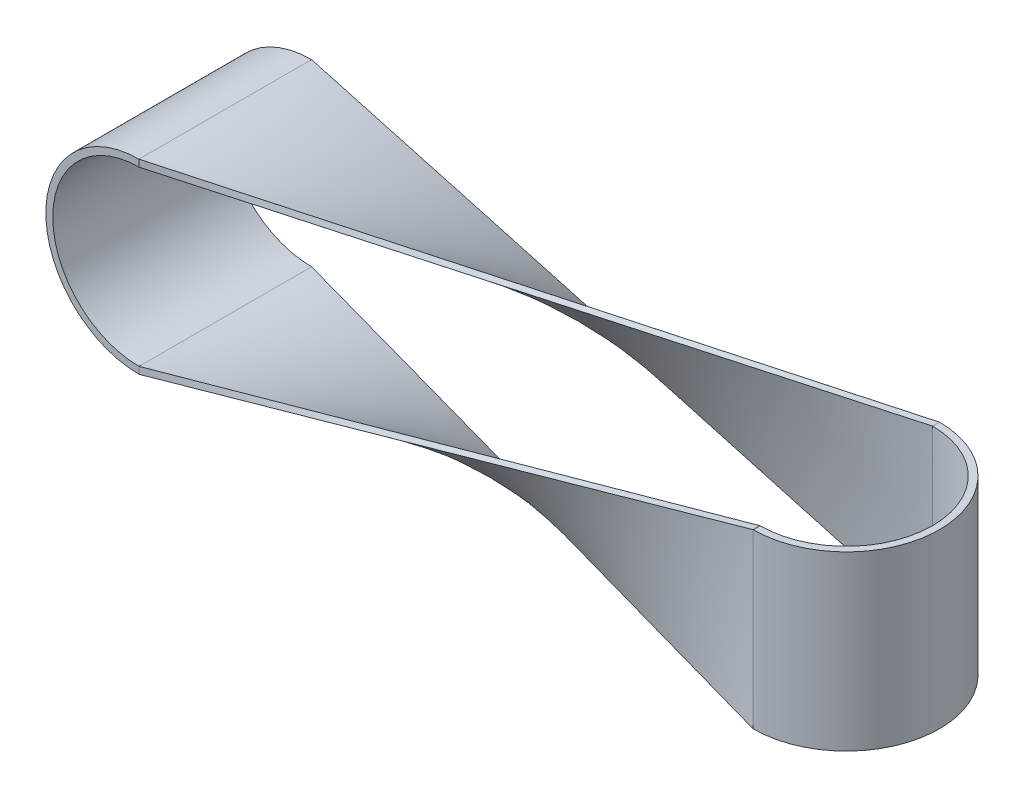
ISO-10303-21;
HEADER;
FILE_DESCRIPTION(('STEP AP214'),'2;1');
FILE_NAME('part.step','',(''),(''),'','','');
FILE_SCHEMA(('AUTOMOTIVE_DESIGN { 1 0 10303 214 1 1 1 1 }'));
ENDSEC;
DATA;
#1=APPLICATION_CONTEXT('core data for automotive mechanical design processes');
#2=APPLICATION_PROTOCOL_DEFINITION('international standard','automotive_design',2000,#1);
#3=PRODUCT_CONTEXT('',#1,'mechanical');
#4=PRODUCT('Part','Part','',(#3));
#5=PRODUCT_RELATED_PRODUCT_CATEGORY('part','',(#4));
#6=PRODUCT_DEFINITION_FORMATION('','',#4);
#7=PRODUCT_DEFINITION_CONTEXT('part definition',#1,'design');
#8=PRODUCT_DEFINITION('design','',#6,#7);
#9=PRODUCT_DEFINITION_SHAPE('','',#8);
#10=(LENGTH_UNIT() NAMED_UNIT(*) SI_UNIT(.MILLI.,.METRE.));
#11=(NAMED_UNIT(*) PLANE_ANGLE_UNIT() SI_UNIT($,.RADIAN.));
#12=(NAMED_UNIT(*) SI_UNIT($,.STERADIAN.) SOLID_ANGLE_UNIT());
#13=UNCERTAINTY_MEASURE_WITH_UNIT(LENGTH_MEASURE(1.E-05),#10,'distance_accuracy_value','');
#14=(GEOMETRIC_REPRESENTATION_CONTEXT(3) GLOBAL_UNCERTAINTY_ASSIGNED_CONTEXT((#13)) GLOBAL_UNIT_ASSIGNED_CONTEXT((#10,
#11,#12)) REPRESENTATION_CONTEXT('',''));
#15=CARTESIAN_POINT('',(0.,0.,0.));
#16=DIRECTION('',(0.,0.,1.));
#17=DIRECTION('',(1.,0.,0.));
#18=AXIS2_PLACEMENT_3D('',#15,#16,#17);
#19=CARTESIAN_POINT('',(0.,0.,50.));
#20=DIRECTION('',(0.,0.,-1.));
#21=DIRECTION('',(-1.,0.,0.));
#22=AXIS2_PLACEMENT_3D('',#19,#20,#21);
#23=CYLINDRICAL_SURFACE('',#22,25.);
#24=CARTESIAN_POINT('',(0.,0.,0.));
#25=DIRECTION('',(0.,0.,-1.));
#26=DIRECTION('',(1.,0.,0.));
#27=AXIS2_PLACEMENT_3D('',#24,#25,#26);
#28=CIRCLE('',#27,25.);
#29=CARTESIAN_POINT('',(0.,-25.,0.));
#30=VERTEX_POINT('',#29);
#31=CARTESIAN_POINT('',(0.,25.,0.));
#32=VERTEX_POINT('',#31);
#33=EDGE_CURVE('E239',#30,#32,#28,.T.);
#34=ORIENTED_EDGE('',*,*,#33,.T.);
#35=DIRECTION('',(0.,0.,-1.));
#36=VECTOR('',#35,1.);
#37=CARTESIAN_POINT('',(0.,25.,50.));
#38=LINE('',#37,#36);
#39=CARTESIAN_POINT('',(0.,25.,50.));
#40=VERTEX_POINT('',#39);
#41=EDGE_CURVE('E12',#40,#32,#38,.T.);
#42=ORIENTED_EDGE('',*,*,#41,.F.);
#43=CARTESIAN_POINT('',(0.,0.,50.));
#44=DIRECTION('',(0.,0.,-1.));
#45=DIRECTION('',(1.,0.,0.));
#46=AXIS2_PLACEMENT_3D('',#43,#44,#45);
#47=CIRCLE('',#46,25.);
#48=CARTESIAN_POINT('',(0.,-25.,50.));
#49=VERTEX_POINT('',#48);
#50=EDGE_CURVE('E200',#49,#40,#47,.T.);
#51=ORIENTED_EDGE('',*,*,#50,.F.);
#52=DIRECTION('',(0.,0.,-1.));
#53=VECTOR('',#52,1.);
#54=CARTESIAN_POINT('',(0.,-25.,50.));
#55=LINE('',#54,#53);
#56=EDGE_CURVE('E238',#49,#30,#55,.T.);
#57=ORIENTED_EDGE('',*,*,#56,.T.);
#58=EDGE_LOOP('',(#34,#42,#51,#57));
#59=FACE_BOUND('',#58,.T.);
#60=ADVANCED_FACE('F143',(#59),#23,.F.);
#61=CARTESIAN_POINT('',(0.,0.,50.));
#62=DIRECTION('',(0.,0.,-1.));
#63=DIRECTION('',(-1.,0.,0.));
#64=AXIS2_PLACEMENT_3D('',#61,#62,#63);
#65=CYLINDRICAL_SURFACE('',#64,27.);
#66=CARTESIAN_POINT('',(0.,0.,0.));
#67=DIRECTION('',(0.,0.,1.));
#68=DIRECTION('',(1.,0.,0.));
#69=AXIS2_PLACEMENT_3D('',#66,#67,#68);
#70=CIRCLE('',#69,27.);
#71=CARTESIAN_POINT('',(0.,27.,0.));
#72=VERTEX_POINT('',#71);
#73=CARTESIAN_POINT('',(0.,-27.,0.));
#74=VERTEX_POINT('',#73);
#75=EDGE_CURVE('E245',#72,#74,#70,.T.);
#76=ORIENTED_EDGE('',*,*,#75,.T.);
#77=DIRECTION('',(0.,0.,-1.));
#78=VECTOR('',#77,1.);
#79=CARTESIAN_POINT('',(0.,-27.,50.));
#80=LINE('',#79,#78);
#81=CARTESIAN_POINT('',(0.,-27.,50.));
#82=VERTEX_POINT('',#81);
#83=EDGE_CURVE('E207',#82,#74,#80,.T.);
#84=ORIENTED_EDGE('',*,*,#83,.F.);
#85=CARTESIAN_POINT('',(0.,0.,50.));
#86=DIRECTION('',(0.,0.,1.));
#87=DIRECTION('',(1.,0.,0.));
#88=AXIS2_PLACEMENT_3D('',#85,#86,#87);
#89=CIRCLE('',#88,27.);
#90=CARTESIAN_POINT('',(0.,27.,50.));
#91=VERTEX_POINT('',#90);
#92=EDGE_CURVE('E198',#91,#82,#89,.T.);
#93=ORIENTED_EDGE('',*,*,#92,.F.);
#94=DIRECTION('',(0.,0.,-1.));
#95=VECTOR('',#94,1.);
#96=CARTESIAN_POINT('',(0.,27.,50.));
#97=LINE('',#96,#95);
#98=EDGE_CURVE('E151',#91,#72,#97,.T.);
#99=ORIENTED_EDGE('',*,*,#98,.T.);
#100=EDGE_LOOP('',(#76,#84,#93,#99));
#101=FACE_BOUND('',#100,.T.);
#102=ADVANCED_FACE('F205',(#101),#65,.T.);
#103=CARTESIAN_POINT('',(0.,0.,50.));
#104=DIRECTION('',(0.,0.,1.));
#105=DIRECTION('',(1.,0.,0.));
#106=AXIS2_PLACEMENT_3D('',#103,#104,#105);
#107=PLANE('',#106);
#108=ORIENTED_EDGE('',*,*,#50,.T.);
#109=DIRECTION('',(0.,1.,0.));
#110=VECTOR('',#109,1.);
#111=CARTESIAN_POINT('',(0.,25.,50.));
#112=LINE('',#111,#110);
#113=EDGE_CURVE('E196',#40,#91,#112,.T.);
#114=ORIENTED_EDGE('',*,*,#113,.T.);
#115=ORIENTED_EDGE('',*,*,#92,.T.);
#116=DIRECTION('',(0.,1.,0.));
#117=VECTOR('',#116,1.);
#118=CARTESIAN_POINT('',(0.,-27.,50.));
#119=LINE('',#118,#117);
#120=EDGE_CURVE('E159',#82,#49,#119,.T.);
#121=ORIENTED_EDGE('',*,*,#120,.T.);
#122=EDGE_LOOP('',(#108,#114,#115,#121));
#123=FACE_BOUND('',#122,.T.);
#124=ADVANCED_FACE('F197',(#123),#107,.T.);
#125=CARTESIAN_POINT('',(0.,0.,0.));
#126=DIRECTION('',(0.,0.,1.));
#127=DIRECTION('',(1.,0.,0.));
#128=AXIS2_PLACEMENT_3D('',#125,#126,#127);
#129=PLANE('',#128);
#130=ORIENTED_EDGE('',*,*,#33,.F.);
#131=DIRECTION('',(0.,1.,0.));
#132=VECTOR('',#131,1.);
#133=CARTESIAN_POINT('',(0.,-27.,0.));
#134=LINE('',#133,#132);
#135=EDGE_CURVE('E235',#74,#30,#134,.T.);
#136=ORIENTED_EDGE('',*,*,#135,.F.);
#137=ORIENTED_EDGE('',*,*,#75,.F.);
#138=DIRECTION('',(0.,1.,0.));
#139=VECTOR('',#138,1.);
#140=CARTESIAN_POINT('',(0.,25.,0.));
#141=LINE('',#140,#139);
#142=EDGE_CURVE('E241',#32,#72,#141,.T.);
#143=ORIENTED_EDGE('',*,*,#142,.F.);
#144=EDGE_LOOP('',(#130,#136,#137,#143));
#145=FACE_BOUND('',#144,.T.);
#146=ADVANCED_FACE('F332',(#145),#129,.F.);
#147=CARTESIAN_POINT('',(0.,27.,50.));
#148=CARTESIAN_POINT('',(180.,25.,-2.));
#149=CARTESIAN_POINT('',(0.,25.,50.));
#150=CARTESIAN_POINT('',(180.,25.,0.));
#151=B_SPLINE_SURFACE_WITH_KNOTS('',1,1,((#147,#148),(#149,#150)),.UNSPECIFIED.,.F.,.F.,.F.,(2,
2),(2,2),(0.,1.),(0.,1.),.UNSPECIFIED.);
#152=DIRECTION('',(0.963517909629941,0.,-0.267643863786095));
#153=VECTOR('',#152,1.);
#154=CARTESIAN_POINT('',(90.,25.,25.));
#155=LINE('',#154,#153);
#156=CARTESIAN_POINT('',(180.,25.,0.));
#157=VERTEX_POINT('',#156);
#158=EDGE_CURVE('E242',#40,#157,#155,.T.);
#159=DIRECTION('',(0.,0.,1.));
#160=VECTOR('',#159,1.);
#161=CARTESIAN_POINT('',(180.,25.,-1.));
#162=LINE('',#161,#160);
#163=CARTESIAN_POINT('',(180.,25.,-2.));
#164=VERTEX_POINT('',#163);
#165=EDGE_CURVE('E219',#164,#157,#162,.T.);
#166=DIRECTION('',(0.960659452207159,-0.0106739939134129,-0.277523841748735));
#167=VECTOR('',#166,1.);
#168=CARTESIAN_POINT('',(90.,26.,24.));
#169=LINE('',#168,#167);
#170=EDGE_CURVE('E213',#91,#164,#169,.T.);
#171=ORIENTED_EDGE('',*,*,#113,.F.);
#172=ORIENTED_EDGE('',*,*,#158,.T.);
#173=ORIENTED_EDGE('',*,*,#165,.F.);
#174=ORIENTED_EDGE('',*,*,#170,.F.);
#175=EDGE_LOOP('',(#171,#172,#173,#174));
#176=FACE_BOUND('',#175,.T.);
#177=ADVANCED_FACE('F217',(#176),#151,.T.);
#178=CARTESIAN_POINT('',(0.,25.,50.));
#179=CARTESIAN_POINT('',(180.,25.,0.));
#180=CARTESIAN_POINT('',(0.,25.,0.));
#181=CARTESIAN_POINT('',(180.,-25.,0.));
#182=B_SPLINE_SURFACE_WITH_KNOTS('',1,1,((#178,#179),(#180,#181)),.UNSPECIFIED.,.F.,.F.,.F.,(2,
2),(2,2),(0.,1.),(0.,1.),.UNSPECIFIED.);
#183=DIRECTION('',(0.963517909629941,-0.267643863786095,0.));
#184=VECTOR('',#183,1.);
#185=CARTESIAN_POINT('',(90.,0.,0.));
#186=LINE('',#185,#184);
#187=CARTESIAN_POINT('',(180.,-25.,0.));
#188=VERTEX_POINT('',#187);
#189=EDGE_CURVE('E222',#32,#188,#186,.T.);
#190=DIRECTION('',(0.,-1.,0.));
#191=VECTOR('',#190,1.);
#192=CARTESIAN_POINT('',(180.,0.,0.));
#193=LINE('',#192,#191);
#194=EDGE_CURVE('E181',#157,#188,#193,.T.);
#195=ORIENTED_EDGE('',*,*,#41,.T.);
#196=ORIENTED_EDGE('',*,*,#189,.T.);
#197=ORIENTED_EDGE('',*,*,#194,.F.);
#198=ORIENTED_EDGE('',*,*,#158,.F.);
#199=EDGE_LOOP('',(#195,#196,#197,#198));
#200=FACE_BOUND('',#199,.T.);
#201=ADVANCED_FACE('F300',(#200),#182,.T.);
#202=CARTESIAN_POINT('',(0.,25.,0.));
#203=CARTESIAN_POINT('',(180.,-25.,0.));
#204=CARTESIAN_POINT('',(0.,27.,0.));
#205=CARTESIAN_POINT('',(180.,-25.,-2.));
#206=B_SPLINE_SURFACE_WITH_KNOTS('',1,1,((#202,#203),(#204,#205)),.UNSPECIFIED.,.F.,.F.,.F.,(2,
2),(2,2),(0.,1.),(0.,1.),.UNSPECIFIED.);
#207=DIRECTION('',(0.960659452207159,-0.277523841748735,-0.0106739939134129));
#208=VECTOR('',#207,1.);
#209=CARTESIAN_POINT('',(90.,1.,-1.));
#210=LINE('',#209,#208);
#211=CARTESIAN_POINT('',(180.,-25.,-2.));
#212=VERTEX_POINT('',#211);
#213=EDGE_CURVE('E216',#72,#212,#210,.T.);
#214=DIRECTION('',(0.,0.,-1.));
#215=VECTOR('',#214,1.);
#216=CARTESIAN_POINT('',(180.,-25.,-1.));
#217=LINE('',#216,#215);
#218=EDGE_CURVE('E228',#188,#212,#217,.T.);
#219=ORIENTED_EDGE('',*,*,#142,.T.);
#220=ORIENTED_EDGE('',*,*,#213,.T.);
#221=ORIENTED_EDGE('',*,*,#218,.F.);
#222=ORIENTED_EDGE('',*,*,#189,.F.);
#223=EDGE_LOOP('',(#219,#220,#221,#222));
#224=FACE_BOUND('',#223,.T.);
#225=ADVANCED_FACE('F328',(#224),#206,.T.);
#226=CARTESIAN_POINT('',(0.,27.,0.));
#227=CARTESIAN_POINT('',(180.,-25.,-2.));
#228=CARTESIAN_POINT('',(0.,27.,50.));
#229=CARTESIAN_POINT('',(180.,25.,-2.));
#230=B_SPLINE_SURFACE_WITH_KNOTS('',1,1,((#226,#227),(#228,#229)),.UNSPECIFIED.,.F.,.F.,.F.,(2,
2),(2,2),(0.,1.),(0.,1.),.UNSPECIFIED.);
#231=DIRECTION('',(0.,1.,0.));
#232=VECTOR('',#231,1.);
#233=CARTESIAN_POINT('',(180.,0.,-2.));
#234=LINE('',#233,#232);
#235=EDGE_CURVE('E231',#212,#164,#234,.T.);
#236=ORIENTED_EDGE('',*,*,#98,.F.);
#237=ORIENTED_EDGE('',*,*,#170,.T.);
#238=ORIENTED_EDGE('',*,*,#235,.F.);
#239=ORIENTED_EDGE('',*,*,#213,.F.);
#240=EDGE_LOOP('',(#236,#237,#238,#239));
#241=FACE_BOUND('',#240,.T.);
#242=ADVANCED_FACE('F212',(#241),#230,.T.);
#243=CARTESIAN_POINT('',(180.,25.,25.));
#244=DIRECTION('',(0.,-1.,0.));
#245=DIRECTION('',(0.,0.,-1.));
#246=AXIS2_PLACEMENT_3D('',#243,#244,#245);
#247=CYLINDRICAL_SURFACE('',#246,25.);
#248=CARTESIAN_POINT('',(180.,-25.,25.));
#249=DIRECTION('',(0.,-1.,0.));
#250=DIRECTION('',(0.,0.,1.));
#251=AXIS2_PLACEMENT_3D('',#248,#249,#250);
#252=CIRCLE('',#251,25.);
#253=CARTESIAN_POINT('',(180.,-25.,50.));
#254=VERTEX_POINT('',#253);
#255=EDGE_CURVE('E273',#188,#254,#252,.T.);
#256=ORIENTED_EDGE('',*,*,#255,.T.);
#257=DIRECTION('',(0.,-1.,0.));
#258=VECTOR('',#257,1.);
#259=CARTESIAN_POINT('',(180.,25.,50.));
#260=LINE('',#259,#258);
#261=CARTESIAN_POINT('',(180.,25.,50.));
#262=VERTEX_POINT('',#261);
#263=EDGE_CURVE('E234',#262,#254,#260,.T.);
#264=ORIENTED_EDGE('',*,*,#263,.F.);
#265=CARTESIAN_POINT('',(180.,25.,25.));
#266=DIRECTION('',(0.,-1.,0.));
#267=DIRECTION('',(0.,0.,1.));
#268=AXIS2_PLACEMENT_3D('',#265,#266,#267);
#269=CIRCLE('',#268,25.);
#270=EDGE_CURVE('E280',#157,#262,#269,.T.);
#271=ORIENTED_EDGE('',*,*,#270,.F.);
#272=ORIENTED_EDGE('',*,*,#194,.T.);
#273=EDGE_LOOP('',(#256,#264,#271,#272));
#274=FACE_BOUND('',#273,.T.);
#275=ADVANCED_FACE('F305',(#274),#247,.F.);
#276=CARTESIAN_POINT('',(180.,25.,25.));
#277=DIRECTION('',(0.,-1.,0.));
#278=DIRECTION('',(0.,0.,-1.));
#279=AXIS2_PLACEMENT_3D('',#276,#277,#278);
#280=CYLINDRICAL_SURFACE('',#279,27.);
#281=CARTESIAN_POINT('',(180.,-25.,25.));
#282=DIRECTION('',(0.,1.,0.));
#283=DIRECTION('',(0.,0.,1.));
#284=AXIS2_PLACEMENT_3D('',#281,#282,#283);
#285=CIRCLE('',#284,27.);
#286=CARTESIAN_POINT('',(180.,-25.,52.));
#287=VERTEX_POINT('',#286);
#288=EDGE_CURVE('E284',#287,#212,#285,.T.);
#289=ORIENTED_EDGE('',*,*,#288,.T.);
#290=ORIENTED_EDGE('',*,*,#235,.T.);
#291=CARTESIAN_POINT('',(180.,25.,25.));
#292=DIRECTION('',(0.,1.,0.));
#293=DIRECTION('',(0.,0.,1.));
#294=AXIS2_PLACEMENT_3D('',#291,#292,#293);
#295=CIRCLE('',#294,27.);
#296=CARTESIAN_POINT('',(180.,25.,52.));
#297=VERTEX_POINT('',#296);
#298=EDGE_CURVE('E287',#297,#164,#295,.T.);
#299=ORIENTED_EDGE('',*,*,#298,.F.);
#300=DIRECTION('',(0.,-1.,0.));
#301=VECTOR('',#300,1.);
#302=CARTESIAN_POINT('',(180.,25.,52.));
#303=LINE('',#302,#301);
#304=EDGE_CURVE('E289',#297,#287,#303,.T.);
#305=ORIENTED_EDGE('',*,*,#304,.T.);
#306=EDGE_LOOP('',(#289,#290,#299,#305));
#307=FACE_BOUND('',#306,.T.);
#308=ADVANCED_FACE('F326',(#307),#280,.T.);
#309=CARTESIAN_POINT('',(180.,25.,25.));
#310=DIRECTION('',(0.,1.,0.));
#311=DIRECTION('',(0.,0.,1.));
#312=AXIS2_PLACEMENT_3D('',#309,#310,#311);
#313=PLANE('',#312);
#314=ORIENTED_EDGE('',*,*,#270,.T.);
#315=DIRECTION('',(0.,0.,1.));
#316=VECTOR('',#315,1.);
#317=CARTESIAN_POINT('',(180.,25.,50.));
#318=LINE('',#317,#316);
#319=EDGE_CURVE('E283',#262,#297,#318,.T.);
#320=ORIENTED_EDGE('',*,*,#319,.T.);
#321=ORIENTED_EDGE('',*,*,#298,.T.);
#322=ORIENTED_EDGE('',*,*,#165,.T.);
#323=EDGE_LOOP('',(#314,#320,#321,#322));
#324=FACE_BOUND('',#323,.T.);
#325=ADVANCED_FACE('F323',(#324),#313,.T.);
#326=CARTESIAN_POINT('',(180.,-25.,25.));
#327=DIRECTION('',(0.,1.,0.));
#328=DIRECTION('',(0.,0.,1.));
#329=AXIS2_PLACEMENT_3D('',#326,#327,#328);
#330=PLANE('',#329);
#331=ORIENTED_EDGE('',*,*,#255,.F.);
#332=ORIENTED_EDGE('',*,*,#218,.T.);
#333=ORIENTED_EDGE('',*,*,#288,.F.);
#334=DIRECTION('',(0.,0.,1.));
#335=VECTOR('',#334,1.);
#336=CARTESIAN_POINT('',(180.,-25.,50.));
#337=LINE('',#336,#335);
#338=EDGE_CURVE('E270',#254,#287,#337,.T.);
#339=ORIENTED_EDGE('',*,*,#338,.F.);
#340=EDGE_LOOP('',(#331,#332,#333,#339));
#341=FACE_BOUND('',#340,.T.);
#342=ADVANCED_FACE('F308',(#341),#330,.F.);
#343=CARTESIAN_POINT('',(180.,25.,50.));
#344=CARTESIAN_POINT('',(0.,-25.,50.));
#345=CARTESIAN_POINT('',(180.,-25.,50.));
#346=CARTESIAN_POINT('',(0.,-25.,0.));
#347=B_SPLINE_SURFACE_WITH_KNOTS('',1,1,((#343,#344),(#345,#346)),.UNSPECIFIED.,.F.,.F.,.F.,(2,
2),(2,2),(0.,1.),(0.,1.),.UNSPECIFIED.);
#348=DIRECTION('',(-0.963517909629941,0.,-0.267643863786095));
#349=VECTOR('',#348,1.);
#350=CARTESIAN_POINT('',(90.,-25.,25.));
#351=LINE('',#350,#349);
#352=EDGE_CURVE('E271',#254,#30,#351,.T.);
#353=DIRECTION('',(-0.963517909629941,-0.267643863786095,0.));
#354=VECTOR('',#353,1.);
#355=CARTESIAN_POINT('',(90.,0.,50.));
#356=LINE('',#355,#354);
#357=EDGE_CURVE('E275',#262,#49,#356,.T.);
#358=ORIENTED_EDGE('',*,*,#263,.T.);
#359=ORIENTED_EDGE('',*,*,#352,.T.);
#360=ORIENTED_EDGE('',*,*,#56,.F.);
#361=ORIENTED_EDGE('',*,*,#357,.F.);
#362=EDGE_LOOP('',(#358,#359,#360,#361));
#363=FACE_BOUND('',#362,.T.);
#364=ADVANCED_FACE('F313',(#363),#347,.T.);
#365=CARTESIAN_POINT('',(180.,-25.,50.));
#366=CARTESIAN_POINT('',(0.,-25.,0.));
#367=CARTESIAN_POINT('',(180.,-25.,52.));
#368=CARTESIAN_POINT('',(0.,-27.,0.));
#369=B_SPLINE_SURFACE_WITH_KNOTS('',1,1,((#365,#366),(#367,#368)),.UNSPECIFIED.,.F.,.F.,.F.,(2,
2),(2,2),(0.,1.),(0.,1.),.UNSPECIFIED.);
#370=DIRECTION('',(-0.960659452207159,-0.0106739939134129,-0.277523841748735));
#371=VECTOR('',#370,1.);
#372=CARTESIAN_POINT('',(90.,-26.,26.));
#373=LINE('',#372,#371);
#374=EDGE_CURVE('E258',#287,#74,#373,.T.);
#375=ORIENTED_EDGE('',*,*,#338,.T.);
#376=ORIENTED_EDGE('',*,*,#374,.T.);
#377=ORIENTED_EDGE('',*,*,#135,.T.);
#378=ORIENTED_EDGE('',*,*,#352,.F.);
#379=EDGE_LOOP('',(#375,#376,#377,#378));
#380=FACE_BOUND('',#379,.T.);
#381=ADVANCED_FACE('F266',(#380),#369,.T.);
#382=CARTESIAN_POINT('',(180.,-25.,52.));
#383=CARTESIAN_POINT('',(0.,-27.,0.));
#384=CARTESIAN_POINT('',(180.,25.,52.));
#385=CARTESIAN_POINT('',(0.,-27.,50.));
#386=B_SPLINE_SURFACE_WITH_KNOTS('',1,1,((#382,#383),(#384,#385)),.UNSPECIFIED.,.F.,.F.,.F.,(2,
2),(2,2),(0.,1.),(0.,1.),.UNSPECIFIED.);
#387=DIRECTION('',(-0.960659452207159,-0.277523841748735,-0.0106739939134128));
#388=VECTOR('',#387,1.);
#389=CARTESIAN_POINT('',(90.,-1.,51.));
#390=LINE('',#389,#388);
#391=EDGE_CURVE('E260',#297,#82,#390,.T.);
#392=ORIENTED_EDGE('',*,*,#304,.F.);
#393=ORIENTED_EDGE('',*,*,#391,.T.);
#394=ORIENTED_EDGE('',*,*,#83,.T.);
#395=ORIENTED_EDGE('',*,*,#374,.F.);
#396=EDGE_LOOP('',(#392,#393,#394,#395));
#397=FACE_BOUND('',#396,.T.);
#398=ADVANCED_FACE('F256',(#397),#386,.T.);
#399=CARTESIAN_POINT('',(180.,25.,52.));
#400=CARTESIAN_POINT('',(0.,-27.,50.));
#401=CARTESIAN_POINT('',(180.,25.,50.));
#402=CARTESIAN_POINT('',(0.,-25.,50.));
#403=B_SPLINE_SURFACE_WITH_KNOTS('',1,1,((#399,#400),(#401,#402)),.UNSPECIFIED.,.F.,.F.,.F.,(2,
2),(2,2),(0.,1.),(0.,1.),.UNSPECIFIED.);
#404=ORIENTED_EDGE('',*,*,#319,.F.);
#405=ORIENTED_EDGE('',*,*,#357,.T.);
#406=ORIENTED_EDGE('',*,*,#120,.F.);
#407=ORIENTED_EDGE('',*,*,#391,.F.);
#408=EDGE_LOOP('',(#404,#405,#406,#407));
#409=FACE_BOUND('',#408,.T.);
#410=ADVANCED_FACE('F320',(#409),#403,.T.);
#411=CLOSED_SHELL('',(#60,#102,#124,#146,#177,#201,#225,#242,#275,#308,#325,#342,#364,#381,#398,#410));
#412=MANIFOLD_SOLID_BREP('B2',#411);
#413=ADVANCED_BREP_SHAPE_REPRESENTATION('',(#18,#412),#14);
#414=SHAPE_DEFINITION_REPRESENTATION(#9,#413);
ENDSEC;
END-ISO-10303-21;
